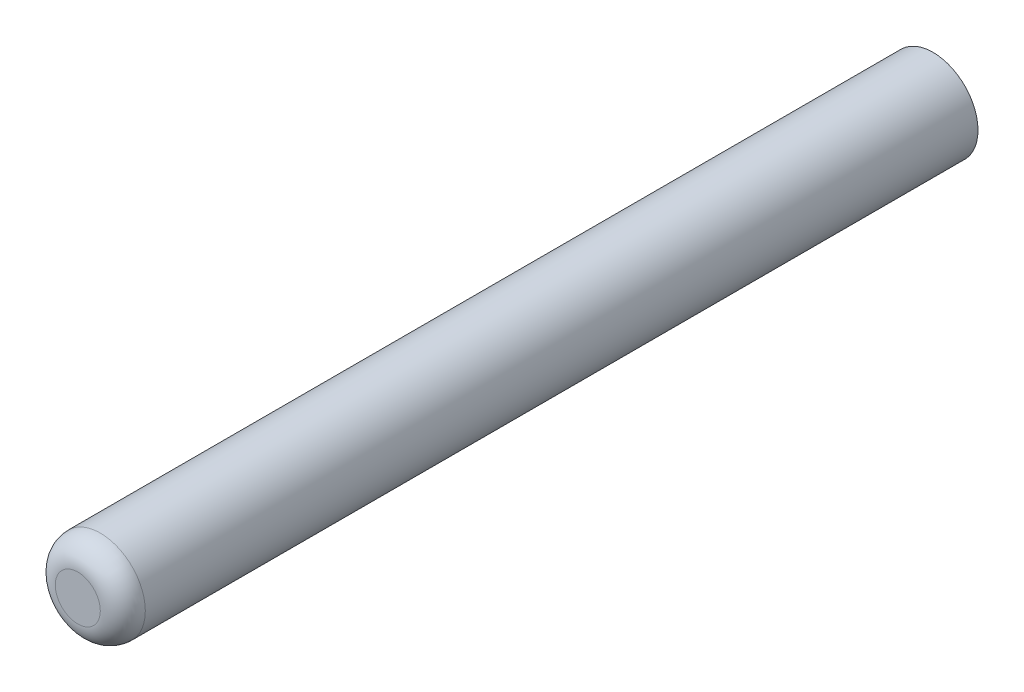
ISO-10303-21;
HEADER;
FILE_DESCRIPTION(('STEP AP214'),'2;1');
FILE_NAME('part.step','',(''),(''),'','','');
FILE_SCHEMA(('AUTOMOTIVE_DESIGN { 1 0 10303 214 1 1 1 1 }'));
ENDSEC;
DATA;
#1=APPLICATION_CONTEXT('core data for automotive mechanical design processes');
#2=APPLICATION_PROTOCOL_DEFINITION('international standard','automotive_design',2000,#1);
#3=PRODUCT_CONTEXT('',#1,'mechanical');
#4=PRODUCT('Part','Part','',(#3));
#5=PRODUCT_RELATED_PRODUCT_CATEGORY('part','',(#4));
#6=PRODUCT_DEFINITION_FORMATION('','',#4);
#7=PRODUCT_DEFINITION_CONTEXT('part definition',#1,'design');
#8=PRODUCT_DEFINITION('design','',#6,#7);
#9=PRODUCT_DEFINITION_SHAPE('','',#8);
#10=(LENGTH_UNIT() NAMED_UNIT(*) SI_UNIT(.MILLI.,.METRE.));
#11=(NAMED_UNIT(*) PLANE_ANGLE_UNIT() SI_UNIT($,.RADIAN.));
#12=(NAMED_UNIT(*) SI_UNIT($,.STERADIAN.) SOLID_ANGLE_UNIT());
#13=UNCERTAINTY_MEASURE_WITH_UNIT(LENGTH_MEASURE(1.E-05),#10,'distance_accuracy_value','');
#14=(GEOMETRIC_REPRESENTATION_CONTEXT(3) GLOBAL_UNCERTAINTY_ASSIGNED_CONTEXT((#13)) GLOBAL_UNIT_ASSIGNED_CONTEXT((#10,
#11,#12)) REPRESENTATION_CONTEXT('',''));
#15=CARTESIAN_POINT('',(0.,0.,0.));
#16=DIRECTION('',(0.,0.,1.));
#17=DIRECTION('',(1.,0.,0.));
#18=AXIS2_PLACEMENT_3D('',#15,#16,#17);
#19=CARTESIAN_POINT('',(0.,0.,9.5));
#20=DIRECTION('',(0.,0.,-1.));
#21=DIRECTION('',(-1.,0.,0.));
#22=AXIS2_PLACEMENT_3D('',#19,#20,#21);
#23=CYLINDRICAL_SURFACE('',#22,0.999999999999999);
#24=CARTESIAN_POINT('',(0.,0.,9.));
#25=DIRECTION('',(0.,0.,1.));
#26=DIRECTION('',(1.,0.,0.));
#27=AXIS2_PLACEMENT_3D('',#24,#25,#26);
#28=CIRCLE('',#27,0.999999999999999);
#29=CARTESIAN_POINT('',(0.999999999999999,0.,9.));
#30=VERTEX_POINT('',#29);
#31=EDGE_CURVE('E10',#30,#30,#28,.F.);
#32=ORIENTED_EDGE('',*,*,#31,.T.);
#33=EDGE_LOOP('',(#32));
#34=FACE_BOUND('',#33,.T.);
#35=CARTESIAN_POINT('',(0.,0.,-9.5));
#36=DIRECTION('',(0.,0.,1.));
#37=DIRECTION('',(1.,0.,0.));
#38=AXIS2_PLACEMENT_3D('',#35,#36,#37);
#39=CIRCLE('',#38,0.999999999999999);
#40=CARTESIAN_POINT('',(0.999999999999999,0.,-9.5));
#41=VERTEX_POINT('',#40);
#42=EDGE_CURVE('E38',#41,#41,#39,.T.);
#43=ORIENTED_EDGE('',*,*,#42,.T.);
#44=EDGE_LOOP('',(#43));
#45=FACE_BOUND('',#44,.T.);
#46=ADVANCED_FACE('F28',(#34,#45),#23,.T.);
#47=CARTESIAN_POINT('',(0.,0.,9.5));
#48=DIRECTION('',(0.,0.,1.));
#49=DIRECTION('',(1.,0.,0.));
#50=AXIS2_PLACEMENT_3D('',#47,#48,#49);
#51=PLANE('',#50);
#52=CARTESIAN_POINT('',(0.,0.,9.5));
#53=DIRECTION('',(0.,0.,1.));
#54=DIRECTION('',(1.,0.,0.));
#55=AXIS2_PLACEMENT_3D('',#52,#53,#54);
#56=CIRCLE('',#55,0.499999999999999);
#57=CARTESIAN_POINT('',(0.499999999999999,0.,9.5));
#58=VERTEX_POINT('',#57);
#59=EDGE_CURVE('E34',#58,#58,#56,.T.);
#60=ORIENTED_EDGE('',*,*,#59,.T.);
#61=EDGE_LOOP('',(#60));
#62=FACE_BOUND('',#61,.T.);
#63=ADVANCED_FACE('F49',(#62),#51,.T.);
#64=CARTESIAN_POINT('',(0.,0.,-9.5));
#65=DIRECTION('',(0.,0.,1.));
#66=DIRECTION('',(1.,0.,0.));
#67=AXIS2_PLACEMENT_3D('',#64,#65,#66);
#68=PLANE('',#67);
#69=ORIENTED_EDGE('',*,*,#42,.F.);
#70=EDGE_LOOP('',(#69));
#71=FACE_BOUND('',#70,.T.);
#72=ADVANCED_FACE('F46',(#71),#68,.F.);
#73=CARTESIAN_POINT('',(0.,0.,9.));
#74=DIRECTION('',(0.,0.,1.));
#75=DIRECTION('',(1.,0.,0.));
#76=AXIS2_PLACEMENT_3D('',#73,#74,#75);
#77=DEGENERATE_TOROIDAL_SURFACE('',#76,0.499999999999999,0.5,.T.);
#78=ORIENTED_EDGE('',*,*,#31,.F.);
#79=EDGE_LOOP('',(#78));
#80=FACE_BOUND('',#79,.T.);
#81=ORIENTED_EDGE('',*,*,#59,.F.);
#82=EDGE_LOOP('',(#81));
#83=FACE_BOUND('',#82,.T.);
#84=ADVANCED_FACE('F48',(#80,#83),#77,.T.);
#85=CLOSED_SHELL('',(#46,#63,#72,#84));
#86=MANIFOLD_SOLID_BREP('B2',#85);
#87=ADVANCED_BREP_SHAPE_REPRESENTATION('',(#18,#86),#14);
#88=SHAPE_DEFINITION_REPRESENTATION(#9,#87);
ENDSEC;
END-ISO-10303-21;
